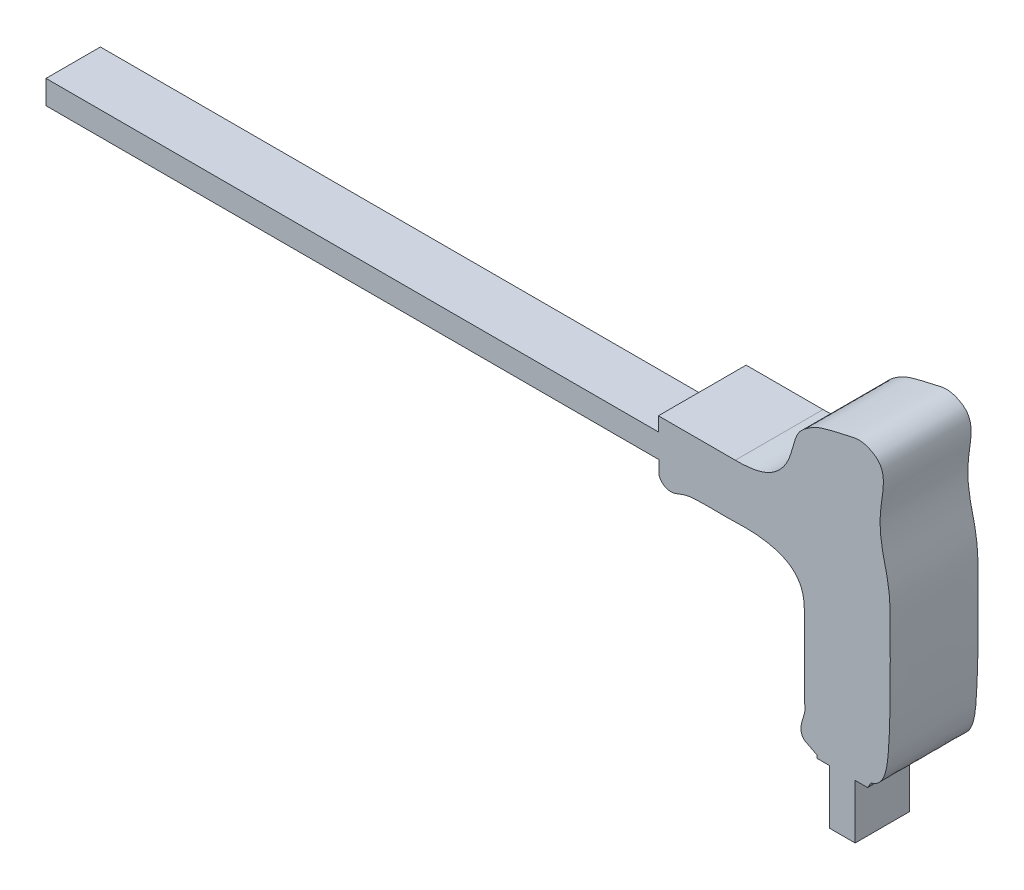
from build123d import *

# Parameters (mm, degrees)
BOSS_EXTRU_2_DEPTH      = 12.5
BOSS_EXTRU_2_DEPTH_BACK = 12.5
ENL_V_START             = -25
ESQUISSE2_W             = 7.245616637
ESQUISSE2_H             = 15.460217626
ENL_V_MAT_EXTRU_1_DEPTH = 9.5


with BuildPart() as part:
    # Esquisse1 → Boss.-Extru.2 (new, two sides: drawn at the far end of the back side and taken through both)
    with BuildSketch(Plane.XY.offset(-BOSS_EXTRU_2_DEPTH_BACK)):
        with BuildLine():
            Line((186.252017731, 80.810811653), (11.769168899, 80.810811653))
            Line((11.769168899, 80.810811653), (11.769168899, 74.053355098))
            Line((11.769168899, 74.053355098), (186.444976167, 74.053355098))
            Line((186.444976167, 74.053355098), (186.444976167, 70.225958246))
            add(Edge.make_bspline(
                [(186.444976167, 70.225958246), (186.830198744, 68.781730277), (189.396498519, 67.201172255), (192.280495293, 68.532958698), (196.136505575, 69.750785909), (199.300789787, 69.425960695), (201.714958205, 69.518271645)],
                knots=[0, 0, 0, 0, 0.259940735, 0.446406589, 0.55201192, 1, 1, 1, 1], degree=3))
            add(Edge.make_bspline(
                [(201.714958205, 69.518271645), (205.529489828, 69.321935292), (211.38052369, 69.95398321), (218.581604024, 68.965733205), (223.046807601, 67.378708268), (225.909181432, 64.971408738), (228.190350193, 60.421652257), (227.815743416, 56.483053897), (227.857241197, 53.833080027)],
                knots=[0, 0, 0, 0, 0.312765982, 0.478190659, 0.591351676, 0.696911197, 0.775100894, 1, 1, 1, 1], degree=3))
            Line((227.857241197, 53.833080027), (227.857241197, 34.807233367))
            add(Edge.make_bspline(
                [(227.857241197, 34.807233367), (228.554159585, 32.371146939), (226.189140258, 29.426275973), (227.180498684, 25.960699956), (228.0659227, 25.412808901)],
                knots=[0, 0, 0, 0, 0.703509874, 1, 1, 1, 1], degree=3))
            Line((228.0659227, 25.412808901), (231.488323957, 23.674582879))
            Line((231.488323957, 23.674582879), (231.488323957, 22.858714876))
            Line((231.488323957, 22.858714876), (235.073876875, 22.858714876))
            Line((235.073876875, 22.858714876), (235.073876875, 7.39849725))
            Line((235.073876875, 7.39849725), (242.319493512, 7.39849725))
            Line((242.319493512, 7.39849725), (242.319493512, 22.858714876))
            Line((242.319493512, 22.858714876), (245.846148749, 22.858714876))
            Line((245.846148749, 22.858714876), (246.84624501, 24.490450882))
            add(Edge.make_bspline(
                [(208.169740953, 84.793974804), (211.440919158, 84.799959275), (217.031270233, 85.22200235), (222.148266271, 89.802209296), (224.05933204, 94.059902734), (224.888427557, 97.779921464), (226.196774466, 100.990119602), (228.687748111, 102.997570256), (230.830750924, 104.32510279), (233.426238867, 105.239518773), (236.424450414, 106.030582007), (239.956695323, 106.793865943), (243.634586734, 107.700482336), (246.715346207, 106.717748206), (248.994135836, 105.18210646), (250.217071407, 102.968126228), (250.444664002, 100.175824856), (250.051953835, 96.390007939), (249.27625752, 91.866525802), (249.485743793, 86.591752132), (250.455225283, 81.532822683), (251.73363636, 76.630825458), (252.489052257, 69.724420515), (252.24962874, 62.171381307), (252.375111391, 53.548490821), (252.279225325, 44.950801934), (252.00637692, 36.894912), (251.321750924, 29.175937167), (249.541350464, 25.14495368), (246.84624501, 24.490450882)],
                knots=[0, 0, 0, 0, 0.074447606, 0.116851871, 0.145986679, 0.177015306, 0.202387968, 0.22073974, 0.247107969, 0.25829824, 0.281918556, 0.316068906, 0.339446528, 0.364510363, 0.385522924, 0.399163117, 0.4193207, 0.446717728, 0.484118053, 0.521255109, 0.563573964, 0.598748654, 0.634020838, 0.717904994, 0.76688659, 0.82619388, 0.909624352, 0.945901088, 1, 1, 1, 1], degree=3))
            Line((208.169740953, 84.793974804), (186.252017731, 84.793974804))
            Line((186.252017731, 84.793974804), (186.252017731, 80.810811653))
        make_face()
    extrude(amount=BOSS_EXTRU_2_DEPTH + BOSS_EXTRU_2_DEPTH_BACK)

    # Esquisse2 → Enl_v. mat.-Extru.1 (cut)
    with BuildSketch(Plane.XY.offset(12.5).offset(ENL_V_START)):
        with Locations((238.696685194, 15.128606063)):
            Rectangle(ESQUISSE2_W, ESQUISSE2_H)
        Polygon((11.769168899, 74.053355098), (186.444976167, 74.053355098), (186.252017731, 80.810811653), (11.769168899, 80.810811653), align=None)
    extrude(amount=ENL_V_MAT_EXTRU_1_DEPTH, mode=Mode.SUBTRACT)


solid = part.part
